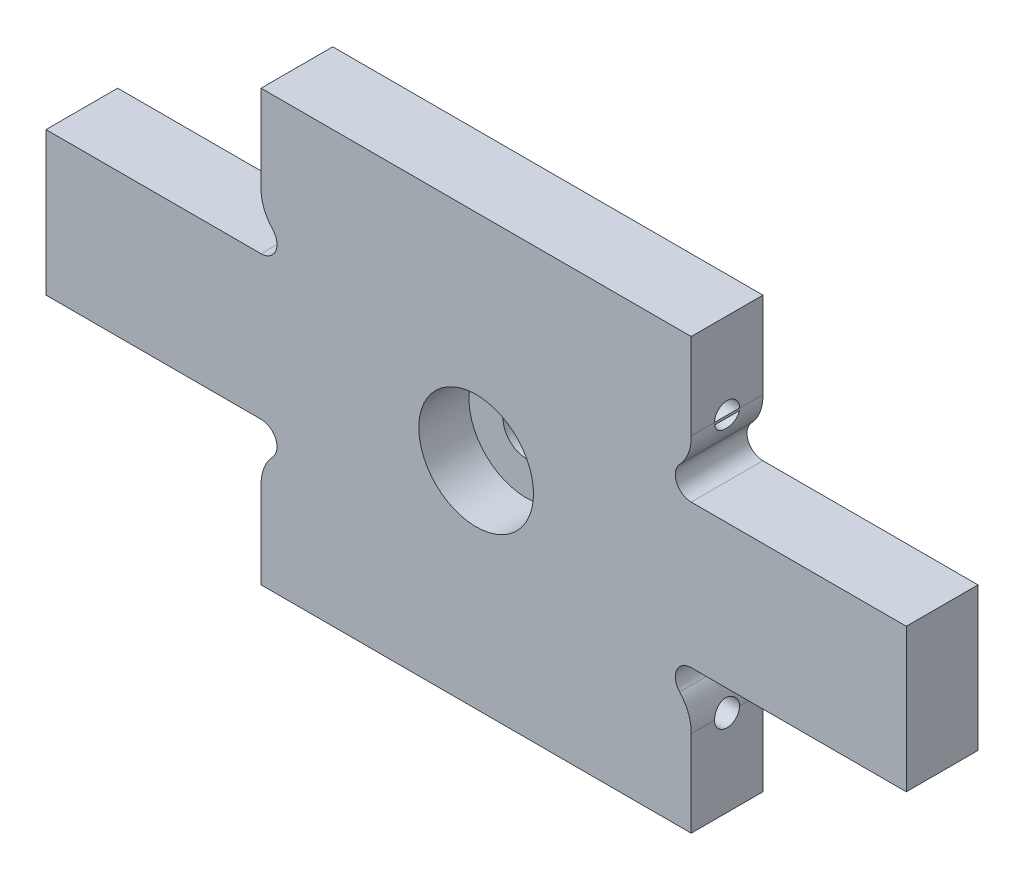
ISO-10303-21;
HEADER;
FILE_DESCRIPTION(('STEP AP214'),'2;1');
FILE_NAME('part.step','',(''),(''),'','','');
FILE_SCHEMA(('AUTOMOTIVE_DESIGN { 1 0 10303 214 1 1 1 1 }'));
ENDSEC;
DATA;
#1=APPLICATION_CONTEXT('core data for automotive mechanical design processes');
#2=APPLICATION_PROTOCOL_DEFINITION('international standard','automotive_design',2000,#1);
#3=PRODUCT_CONTEXT('',#1,'mechanical');
#4=PRODUCT('Part','Part','',(#3));
#5=PRODUCT_RELATED_PRODUCT_CATEGORY('part','',(#4));
#6=PRODUCT_DEFINITION_FORMATION('','',#4);
#7=PRODUCT_DEFINITION_CONTEXT('part definition',#1,'design');
#8=PRODUCT_DEFINITION('design','',#6,#7);
#9=PRODUCT_DEFINITION_SHAPE('','',#8);
#10=(LENGTH_UNIT() NAMED_UNIT(*) SI_UNIT(.MILLI.,.METRE.));
#11=(NAMED_UNIT(*) PLANE_ANGLE_UNIT() SI_UNIT($,.RADIAN.));
#12=(NAMED_UNIT(*) SI_UNIT($,.STERADIAN.) SOLID_ANGLE_UNIT());
#13=UNCERTAINTY_MEASURE_WITH_UNIT(LENGTH_MEASURE(1.E-05),#10,'distance_accuracy_value','');
#14=(GEOMETRIC_REPRESENTATION_CONTEXT(3) GLOBAL_UNCERTAINTY_ASSIGNED_CONTEXT((#13)) GLOBAL_UNIT_ASSIGNED_CONTEXT((#10,
#11,#12)) REPRESENTATION_CONTEXT('',''));
#15=CARTESIAN_POINT('',(0.,0.,0.));
#16=DIRECTION('',(0.,0.,1.));
#17=DIRECTION('',(1.,0.,0.));
#18=AXIS2_PLACEMENT_3D('',#15,#16,#17);
#19=CARTESIAN_POINT('',(30.,30.,10.));
#20=DIRECTION('',(-1.,0.,0.));
#21=DIRECTION('',(0.,-1.,0.));
#22=AXIS2_PLACEMENT_3D('',#19,#20,#21);
#23=PLANE('',#22);
#24=CARTESIAN_POINT('',(30.,18.,5.));
#25=DIRECTION('',(1.,0.,0.));
#26=DIRECTION('',(0.,0.,-1.));
#27=AXIS2_PLACEMENT_3D('',#24,#25,#26);
#28=CIRCLE('',#27,1.74999999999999);
#29=CARTESIAN_POINT('',(30.,18.,3.25000000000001));
#30=VERTEX_POINT('',#29);
#31=CARTESIAN_POINT('',(30.,18.,6.74999999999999));
#32=VERTEX_POINT('',#31);
#33=EDGE_CURVE('E240',#30,#32,#28,.T.);
#34=ORIENTED_EDGE('',*,*,#33,.F.);
#35=DIRECTION('',(0.,0.,-1.));
#36=VECTOR('',#35,1.);
#37=CARTESIAN_POINT('',(30.,18.,10.));
#38=LINE('',#37,#36);
#39=CARTESIAN_POINT('',(30.,18.,0.));
#40=VERTEX_POINT('',#39);
#41=EDGE_CURVE('E487',#30,#40,#38,.T.);
#42=ORIENTED_EDGE('',*,*,#41,.T.);
#43=DIRECTION('',(0.,1.,0.));
#44=VECTOR('',#43,1.);
#45=CARTESIAN_POINT('',(30.,30.,0.));
#46=LINE('',#45,#44);
#47=CARTESIAN_POINT('',(30.,30.,0.));
#48=VERTEX_POINT('',#47);
#49=EDGE_CURVE('E349',#40,#48,#46,.T.);
#50=ORIENTED_EDGE('',*,*,#49,.T.);
#51=DIRECTION('',(0.,0.,-1.));
#52=VECTOR('',#51,1.);
#53=CARTESIAN_POINT('',(30.,30.,10.));
#54=LINE('',#53,#52);
#55=CARTESIAN_POINT('',(30.,30.,10.));
#56=VERTEX_POINT('',#55);
#57=EDGE_CURVE('E483',#56,#48,#54,.T.);
#58=ORIENTED_EDGE('',*,*,#57,.F.);
#59=DIRECTION('',(0.,1.,0.));
#60=VECTOR('',#59,1.);
#61=CARTESIAN_POINT('',(30.,30.,10.));
#62=LINE('',#61,#60);
#63=CARTESIAN_POINT('',(30.,18.,10.));
#64=VERTEX_POINT('',#63);
#65=EDGE_CURVE('E287',#64,#56,#62,.T.);
#66=ORIENTED_EDGE('',*,*,#65,.F.);
#67=EDGE_CURVE('E488',#64,#32,#38,.T.);
#68=ORIENTED_EDGE('',*,*,#67,.T.);
#69=EDGE_LOOP('',(#34,#42,#50,#58,#66,#68));
#70=FACE_BOUND('',#69,.T.);
#71=ADVANCED_FACE('F45',(#70),#23,.F.);
#72=CARTESIAN_POINT('',(0.,0.,0.));
#73=DIRECTION('',(0.,0.,1.));
#74=DIRECTION('',(1.,0.,0.));
#75=AXIS2_PLACEMENT_3D('',#72,#73,#74);
#76=CYLINDRICAL_SURFACE('',#75,3.25);
#77=CARTESIAN_POINT('',(0.,0.,0.));
#78=DIRECTION('',(0.,0.,1.));
#79=DIRECTION('',(1.,0.,0.));
#80=AXIS2_PLACEMENT_3D('',#77,#78,#79);
#81=CIRCLE('',#80,3.25);
#82=CARTESIAN_POINT('',(3.25,0.,0.));
#83=VERTEX_POINT('',#82);
#84=EDGE_CURVE('E278',#83,#83,#81,.T.);
#85=ORIENTED_EDGE('',*,*,#84,.F.);
#86=EDGE_LOOP('',(#85));
#87=FACE_BOUND('',#86,.T.);
#88=CARTESIAN_POINT('',(0.,0.,3.));
#89=DIRECTION('',(0.,0.,1.));
#90=DIRECTION('',(1.,0.,0.));
#91=AXIS2_PLACEMENT_3D('',#88,#89,#90);
#92=CIRCLE('',#91,3.25);
#93=CARTESIAN_POINT('',(3.25,0.,3.));
#94=VERTEX_POINT('',#93);
#95=EDGE_CURVE('E274',#94,#94,#92,.F.);
#96=ORIENTED_EDGE('',*,*,#95,.F.);
#97=EDGE_LOOP('',(#96));
#98=FACE_BOUND('',#97,.T.);
#99=ADVANCED_FACE('F539',(#87,#98),#76,.F.);
#100=CARTESIAN_POINT('',(24.0021116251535,17.8408301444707,10.));
#101=DIRECTION('',(0.,0.,-1.));
#102=DIRECTION('',(-1.,0.,0.));
#103=AXIS2_PLACEMENT_3D('',#100,#101,#102);
#104=CYLINDRICAL_SURFACE('',#103,6.00000000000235);
#105=CARTESIAN_POINT('',(30.,17.6816602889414,3.27919791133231));
#106=CARTESIAN_POINT('',(29.9987313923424,17.6337424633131,3.28806184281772));
#107=CARTESIAN_POINT('',(29.9968924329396,17.5862353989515,3.29892223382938));
#108=CARTESIAN_POINT('',(29.9921670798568,17.4923496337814,3.32454189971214));
#109=CARTESIAN_POINT('',(29.989280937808,17.4459706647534,3.33930023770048));
#110=CARTESIAN_POINT('',(29.9792095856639,17.3092146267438,3.38919308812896));
#111=CARTESIAN_POINT('',(29.9706030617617,17.2209391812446,3.42999758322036));
#112=CARTESIAN_POINT('',(29.9507233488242,17.0526542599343,3.52541371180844));
#113=CARTESIAN_POINT('',(29.9394511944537,16.9726415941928,3.58001998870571));
#114=CARTESIAN_POINT('',(29.9155983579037,16.8227748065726,3.70155930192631));
#115=CARTESIAN_POINT('',(29.9030172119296,16.7529243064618,3.76849671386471));
#116=CARTESIAN_POINT('',(29.8777467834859,16.6237217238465,3.91460477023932));
#117=CARTESIAN_POINT('',(29.8650614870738,16.5646427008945,3.99401777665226));
#118=CARTESIAN_POINT('',(29.8414450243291,16.4605977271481,4.16185492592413));
#119=CARTESIAN_POINT('',(29.8305138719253,16.4156318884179,4.2502791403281));
#120=CARTESIAN_POINT('',(29.8118198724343,16.3412405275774,4.43361922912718));
#121=CARTESIAN_POINT('',(29.8040524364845,16.3117924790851,4.52852546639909));
#122=CARTESIAN_POINT('',(29.7927035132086,16.2693540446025,4.72218092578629));
#123=CARTESIAN_POINT('',(29.7891208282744,16.256358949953,4.82092904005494));
#124=CARTESIAN_POINT('',(29.7866706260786,16.2474389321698,5.0160343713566));
#125=CARTESIAN_POINT('',(29.7876541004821,16.2509745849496,5.11236539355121));
#126=CARTESIAN_POINT('',(29.7938668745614,16.2737603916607,5.30300554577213));
#127=CARTESIAN_POINT('',(29.7990961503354,16.2930104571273,5.39731468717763));
#128=CARTESIAN_POINT('',(29.8130743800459,16.3463546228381,5.58050609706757));
#129=CARTESIAN_POINT('',(29.8217943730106,16.380326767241,5.6694262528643));
#130=CARTESIAN_POINT('',(29.8416979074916,16.4620650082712,5.84037847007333));
#131=CARTESIAN_POINT('',(29.852881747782,16.5098327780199,5.92240969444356));
#132=CARTESIAN_POINT('',(29.8767647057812,16.6194848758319,6.07988667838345));
#133=CARTESIAN_POINT('',(29.8894989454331,16.6817461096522,6.15506471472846));
#134=CARTESIAN_POINT('',(29.914681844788,16.8179421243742,6.2941067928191));
#135=CARTESIAN_POINT('',(29.9271303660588,16.8918824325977,6.3579654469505));
#136=CARTESIAN_POINT('',(29.9504593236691,17.0510508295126,6.47372665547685));
#137=CARTESIAN_POINT('',(29.9613048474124,17.1364692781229,6.52537458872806));
#138=CARTESIAN_POINT('',(29.9797000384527,17.3150510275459,6.61344855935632));
#139=CARTESIAN_POINT('',(29.9872558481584,17.4081995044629,6.64990295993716));
#140=CARTESIAN_POINT('',(29.9942830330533,17.5330112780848,6.68681922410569));
#141=CARTESIAN_POINT('',(29.9957265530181,17.5625013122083,6.69470639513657));
#142=CARTESIAN_POINT('',(29.9981864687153,17.6218268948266,6.70892101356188));
#143=CARTESIAN_POINT('',(29.9992034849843,17.6516618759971,6.7152507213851));
#144=CARTESIAN_POINT('',(30.,17.6816602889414,6.72080208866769));
#145=B_SPLINE_CURVE_WITH_KNOTS('',3,(#105,#106,#107,#108,#109,#110,#111,#112,#113,#114,#115,
#116,#117,#118,#119,#120,#121,#122,#123,#124,#125,#126,#127,#128,#129,#130,#131,#132,#133,#134,
#135,#136,#137,#138,#139,#140,#141,#142,#143,#144),.UNSPECIFIED.,.F.,.F.,(4,2,2,2,2,2,2,2,2,2,2,
2,2,2,2,2,2,2,2,4),(0.,0.146146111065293,0.292257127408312,0.583637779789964,0.874905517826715,
1.16627680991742,1.4642356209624,1.76219679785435,2.05972423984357,2.35716651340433,
2.64497179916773,2.93277546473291,3.21823925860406,3.50373768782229,3.79770983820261,
4.09182153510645,4.39161125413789,4.69083879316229,4.7824893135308,4.8740060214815),.UNSPECIFIED.);
#146=CARTESIAN_POINT('',(30.,17.6816602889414,3.27919791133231));
#147=VERTEX_POINT('',#146);
#148=CARTESIAN_POINT('',(30.,17.6816602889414,6.72080208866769));
#149=VERTEX_POINT('',#148);
#150=EDGE_CURVE('E55',#147,#149,#145,.T.);
#151=ORIENTED_EDGE('',*,*,#150,.T.);
#152=DIRECTION('',(0.,0.,-1.));
#153=VECTOR('',#152,1.);
#154=CARTESIAN_POINT('',(30.,17.6816602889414,10.));
#155=LINE('',#154,#153);
#156=EDGE_CURVE('E11',#149,#147,#155,.T.);
#157=ORIENTED_EDGE('',*,*,#156,.T.);
#158=EDGE_LOOP('',(#151,#157));
#159=FACE_BOUND('',#158,.T.);
#160=CARTESIAN_POINT('',(24.0021116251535,17.8408301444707,0.));
#161=DIRECTION('',(0.,0.,1.));
#162=DIRECTION('',(-1.,0.,0.));
#163=AXIS2_PLACEMENT_3D('',#160,#161,#162);
#164=CIRCLE('',#163,6.00000000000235);
#165=CARTESIAN_POINT('',(28.3795620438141,13.7374257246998,0.));
#166=VERTEX_POINT('',#165);
#167=EDGE_CURVE('E282',#166,#40,#164,.T.);
#168=ORIENTED_EDGE('',*,*,#167,.T.);
#169=ORIENTED_EDGE('',*,*,#41,.F.);
#170=EDGE_CURVE('E493',#32,#30,#38,.T.);
#171=ORIENTED_EDGE('',*,*,#170,.F.);
#172=ORIENTED_EDGE('',*,*,#67,.F.);
#173=CARTESIAN_POINT('',(24.0021116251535,17.8408301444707,10.));
#174=DIRECTION('',(0.,0.,1.));
#175=DIRECTION('',(-1.,0.,0.));
#176=AXIS2_PLACEMENT_3D('',#173,#174,#175);
#177=CIRCLE('',#176,6.00000000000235);
#178=CARTESIAN_POINT('',(28.3795620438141,13.7374257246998,10.));
#179=VERTEX_POINT('',#178);
#180=EDGE_CURVE('E283',#179,#64,#177,.T.);
#181=ORIENTED_EDGE('',*,*,#180,.F.);
#182=DIRECTION('',(0.,0.,-1.));
#183=VECTOR('',#182,1.);
#184=CARTESIAN_POINT('',(28.3795620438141,13.7374257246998,10.));
#185=LINE('',#184,#183);
#186=EDGE_CURVE('E345',#179,#166,#185,.T.);
#187=ORIENTED_EDGE('',*,*,#186,.T.);
#188=EDGE_LOOP('',(#168,#169,#171,#172,#181,#187));
#189=FACE_BOUND('',#188,.T.);
#190=ADVANCED_FACE('F47',(#159,#189),#104,.T.);
#191=CARTESIAN_POINT('',(30.,30.,10.));
#192=DIRECTION('',(0.,-1.,0.));
#193=DIRECTION('',(1.,0.,0.));
#194=AXIS2_PLACEMENT_3D('',#191,#192,#193);
#195=PLANE('',#194);
#196=DIRECTION('',(-1.,0.,0.));
#197=VECTOR('',#196,1.);
#198=CARTESIAN_POINT('',(30.,30.,0.));
#199=LINE('',#198,#197);
#200=CARTESIAN_POINT('',(-30.,30.,0.));
#201=VERTEX_POINT('',#200);
#202=EDGE_CURVE('E352',#48,#201,#199,.T.);
#203=ORIENTED_EDGE('',*,*,#202,.T.);
#204=DIRECTION('',(0.,0.,-1.));
#205=VECTOR('',#204,1.);
#206=CARTESIAN_POINT('',(-30.,30.,10.));
#207=LINE('',#206,#205);
#208=CARTESIAN_POINT('',(-30.,30.,10.));
#209=VERTEX_POINT('',#208);
#210=EDGE_CURVE('E478',#209,#201,#207,.T.);
#211=ORIENTED_EDGE('',*,*,#210,.F.);
#212=DIRECTION('',(-1.,0.,0.));
#213=VECTOR('',#212,1.);
#214=CARTESIAN_POINT('',(30.,30.,10.));
#215=LINE('',#214,#213);
#216=EDGE_CURVE('E291',#56,#209,#215,.T.);
#217=ORIENTED_EDGE('',*,*,#216,.F.);
#218=ORIENTED_EDGE('',*,*,#57,.T.);
#219=EDGE_LOOP('',(#203,#211,#217,#218));
#220=FACE_BOUND('',#219,.T.);
#221=ADVANCED_FACE('F619',(#220),#195,.F.);
#222=CARTESIAN_POINT('',(-30.,30.,10.));
#223=DIRECTION('',(1.,0.,0.));
#224=DIRECTION('',(0.,1.,0.));
#225=AXIS2_PLACEMENT_3D('',#222,#223,#224);
#226=PLANE('',#225);
#227=DIRECTION('',(0.,0.,-1.));
#228=VECTOR('',#227,1.);
#229=CARTESIAN_POINT('',(-30.,18.,10.));
#230=LINE('',#229,#228);
#231=CARTESIAN_POINT('',(-30.,18.,3.25000000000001));
#232=VERTEX_POINT('',#231);
#233=CARTESIAN_POINT('',(-30.,18.,0.));
#234=VERTEX_POINT('',#233);
#235=EDGE_CURVE('E473',#232,#234,#230,.T.);
#236=ORIENTED_EDGE('',*,*,#235,.F.);
#237=CARTESIAN_POINT('',(-30.,18.,5.));
#238=DIRECTION('',(-1.,0.,0.));
#239=DIRECTION('',(0.,0.,1.));
#240=AXIS2_PLACEMENT_3D('',#237,#238,#239);
#241=CIRCLE('',#240,1.74999999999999);
#242=CARTESIAN_POINT('',(-30.,18.,6.74999999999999));
#243=VERTEX_POINT('',#242);
#244=EDGE_CURVE('E253',#243,#232,#241,.T.);
#245=ORIENTED_EDGE('',*,*,#244,.F.);
#246=CARTESIAN_POINT('',(-30.,18.,10.));
#247=VERTEX_POINT('',#246);
#248=EDGE_CURVE('E474',#247,#243,#230,.T.);
#249=ORIENTED_EDGE('',*,*,#248,.F.);
#250=DIRECTION('',(0.,-1.,0.));
#251=VECTOR('',#250,1.);
#252=CARTESIAN_POINT('',(-30.,30.,10.));
#253=LINE('',#252,#251);
#254=EDGE_CURVE('E294',#209,#247,#253,.T.);
#255=ORIENTED_EDGE('',*,*,#254,.F.);
#256=ORIENTED_EDGE('',*,*,#210,.T.);
#257=DIRECTION('',(0.,-1.,0.));
#258=VECTOR('',#257,1.);
#259=CARTESIAN_POINT('',(-30.,30.,0.));
#260=LINE('',#259,#258);
#261=EDGE_CURVE('E355',#201,#234,#260,.T.);
#262=ORIENTED_EDGE('',*,*,#261,.T.);
#263=EDGE_LOOP('',(#236,#245,#249,#255,#256,#262));
#264=FACE_BOUND('',#263,.T.);
#265=ADVANCED_FACE('F622',(#264),#226,.F.);
#266=CARTESIAN_POINT('',(-24.0021116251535,17.8408301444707,10.));
#267=DIRECTION('',(0.,0.,-1.));
#268=DIRECTION('',(-1.,0.,0.));
#269=AXIS2_PLACEMENT_3D('',#266,#267,#268);
#270=CYLINDRICAL_SURFACE('',#269,6.00000000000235);
#271=CARTESIAN_POINT('',(-30.,17.6816602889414,6.72080208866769));
#272=CARTESIAN_POINT('',(-29.9987313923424,17.6337424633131,6.71193815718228));
#273=CARTESIAN_POINT('',(-29.9968924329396,17.5862353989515,6.70107776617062));
#274=CARTESIAN_POINT('',(-29.9921670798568,17.4923496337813,6.67545810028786));
#275=CARTESIAN_POINT('',(-29.989280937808,17.4459706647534,6.66069976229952));
#276=CARTESIAN_POINT('',(-29.9792095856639,17.3092146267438,6.61080691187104));
#277=CARTESIAN_POINT('',(-29.9706030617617,17.2209391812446,6.57000241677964));
#278=CARTESIAN_POINT('',(-29.9507233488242,17.0526542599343,6.47458628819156));
#279=CARTESIAN_POINT('',(-29.9394511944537,16.9726415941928,6.41998001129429));
#280=CARTESIAN_POINT('',(-29.9155983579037,16.8227748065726,6.29844069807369));
#281=CARTESIAN_POINT('',(-29.9030172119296,16.7529243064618,6.23150328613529));
#282=CARTESIAN_POINT('',(-29.8777467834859,16.6237217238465,6.08539522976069));
#283=CARTESIAN_POINT('',(-29.8650614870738,16.5646427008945,6.00598222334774));
#284=CARTESIAN_POINT('',(-29.8414450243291,16.4605977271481,5.83814507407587));
#285=CARTESIAN_POINT('',(-29.8305138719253,16.4156318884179,5.7497208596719));
#286=CARTESIAN_POINT('',(-29.8118198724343,16.3412405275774,5.56638077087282));
#287=CARTESIAN_POINT('',(-29.8040524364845,16.3117924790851,5.47147453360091));
#288=CARTESIAN_POINT('',(-29.7927035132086,16.2693540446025,5.27781907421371));
#289=CARTESIAN_POINT('',(-29.7891208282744,16.256358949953,5.17907095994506));
#290=CARTESIAN_POINT('',(-29.7866706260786,16.2474389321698,4.9839656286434));
#291=CARTESIAN_POINT('',(-29.7876541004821,16.2509745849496,4.88763460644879));
#292=CARTESIAN_POINT('',(-29.7938668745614,16.2737603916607,4.69699445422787));
#293=CARTESIAN_POINT('',(-29.7990961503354,16.2930104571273,4.60268531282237));
#294=CARTESIAN_POINT('',(-29.8130743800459,16.3463546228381,4.41949390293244));
#295=CARTESIAN_POINT('',(-29.8217943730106,16.380326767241,4.33057374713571));
#296=CARTESIAN_POINT('',(-29.8416979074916,16.4620650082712,4.15962152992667));
#297=CARTESIAN_POINT('',(-29.852881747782,16.5098327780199,4.07759030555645));
#298=CARTESIAN_POINT('',(-29.8767647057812,16.6194848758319,3.92011332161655));
#299=CARTESIAN_POINT('',(-29.8894989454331,16.6817461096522,3.84493528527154));
#300=CARTESIAN_POINT('',(-29.914681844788,16.8179421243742,3.7058932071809));
#301=CARTESIAN_POINT('',(-29.9271303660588,16.8918824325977,3.64203455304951));
#302=CARTESIAN_POINT('',(-29.9504593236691,17.0510508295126,3.52627334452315));
#303=CARTESIAN_POINT('',(-29.9613048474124,17.1364692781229,3.47462541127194));
#304=CARTESIAN_POINT('',(-29.9797000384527,17.3150510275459,3.38655144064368));
#305=CARTESIAN_POINT('',(-29.9872558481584,17.4081995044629,3.35009704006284));
#306=CARTESIAN_POINT('',(-29.9942830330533,17.5330112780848,3.31318077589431));
#307=CARTESIAN_POINT('',(-29.9957265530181,17.5625013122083,3.30529360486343));
#308=CARTESIAN_POINT('',(-29.9981864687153,17.6218268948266,3.29107898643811));
#309=CARTESIAN_POINT('',(-29.9992034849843,17.6516618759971,3.2847492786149));
#310=CARTESIAN_POINT('',(-30.,17.6816602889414,3.27919791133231));
#311=B_SPLINE_CURVE_WITH_KNOTS('',3,(#271,#272,#273,#274,#275,#276,#277,#278,#279,#280,#281,
#282,#283,#284,#285,#286,#287,#288,#289,#290,#291,#292,#293,#294,#295,#296,#297,#298,#299,#300,
#301,#302,#303,#304,#305,#306,#307,#308,#309,#310),.UNSPECIFIED.,.F.,.F.,(4,2,2,2,2,2,2,2,2,2,2,
2,2,2,2,2,2,2,2,4),(0.,0.146146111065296,0.292257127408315,0.583637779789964,0.874905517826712,
1.16627680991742,1.4642356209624,1.76219679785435,2.05972423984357,2.35716651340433,
2.64497179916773,2.93277546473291,3.21823925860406,3.50373768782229,3.79770983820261,
4.09182153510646,4.39161125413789,4.69083879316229,4.7824893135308,4.87400602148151),.UNSPECIFIED.);
#312=CARTESIAN_POINT('',(-30.,17.6816602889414,6.72080208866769));
#313=VERTEX_POINT('',#312);
#314=CARTESIAN_POINT('',(-30.,17.6816602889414,3.27919791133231));
#315=VERTEX_POINT('',#314);
#316=EDGE_CURVE('E506',#313,#315,#311,.T.);
#317=ORIENTED_EDGE('',*,*,#316,.T.);
#318=DIRECTION('',(0.,0.,-1.));
#319=VECTOR('',#318,1.);
#320=CARTESIAN_POINT('',(-30.,17.6816602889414,10.));
#321=LINE('',#320,#319);
#322=EDGE_CURVE('E586',#315,#313,#321,.F.);
#323=ORIENTED_EDGE('',*,*,#322,.T.);
#324=EDGE_LOOP('',(#317,#323));
#325=FACE_BOUND('',#324,.T.);
#326=CARTESIAN_POINT('',(-24.0021116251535,17.8408301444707,0.));
#327=DIRECTION('',(0.,0.,1.));
#328=DIRECTION('',(1.,0.,0.));
#329=AXIS2_PLACEMENT_3D('',#326,#327,#328);
#330=CIRCLE('',#329,6.00000000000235);
#331=CARTESIAN_POINT('',(-28.3795620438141,13.7374257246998,0.));
#332=VERTEX_POINT('',#331);
#333=EDGE_CURVE('E359',#234,#332,#330,.T.);
#334=ORIENTED_EDGE('',*,*,#333,.T.);
#335=DIRECTION('',(0.,0.,-1.));
#336=VECTOR('',#335,1.);
#337=CARTESIAN_POINT('',(-28.3795620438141,13.7374257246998,10.));
#338=LINE('',#337,#336);
#339=CARTESIAN_POINT('',(-28.3795620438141,13.7374257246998,10.));
#340=VERTEX_POINT('',#339);
#341=EDGE_CURVE('E469',#340,#332,#338,.T.);
#342=ORIENTED_EDGE('',*,*,#341,.F.);
#343=CARTESIAN_POINT('',(-24.0021116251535,17.8408301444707,10.));
#344=DIRECTION('',(0.,0.,1.));
#345=DIRECTION('',(1.,0.,0.));
#346=AXIS2_PLACEMENT_3D('',#343,#344,#345);
#347=CIRCLE('',#346,6.00000000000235);
#348=EDGE_CURVE('E297',#247,#340,#347,.T.);
#349=ORIENTED_EDGE('',*,*,#348,.F.);
#350=ORIENTED_EDGE('',*,*,#248,.T.);
#351=EDGE_CURVE('E479',#243,#232,#230,.T.);
#352=ORIENTED_EDGE('',*,*,#351,.T.);
#353=ORIENTED_EDGE('',*,*,#235,.T.);
#354=EDGE_LOOP('',(#334,#342,#349,#350,#352,#353));
#355=FACE_BOUND('',#354,.T.);
#356=ADVANCED_FACE('F625',(#325,#355),#270,.T.);
#357=CARTESIAN_POINT('',(-30.000000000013,12.2199999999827,10.));
#358=DIRECTION('',(0.,0.,-1.));
#359=DIRECTION('',(-1.,0.,0.));
#360=AXIS2_PLACEMENT_3D('',#357,#358,#359);
#361=CYLINDRICAL_SURFACE('',#360,2.21999999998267);
#362=CARTESIAN_POINT('',(-30.000000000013,12.2199999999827,0.));
#363=DIRECTION('',(0.,0.,-1.));
#364=DIRECTION('',(1.,0.,0.));
#365=AXIS2_PLACEMENT_3D('',#362,#363,#364);
#366=CIRCLE('',#365,2.21999999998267);
#367=CARTESIAN_POINT('',(-30.000000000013,10.,0.));
#368=VERTEX_POINT('',#367);
#369=EDGE_CURVE('E362',#332,#368,#366,.T.);
#370=ORIENTED_EDGE('',*,*,#369,.T.);
#371=DIRECTION('',(0.,0.,-1.));
#372=VECTOR('',#371,1.);
#373=CARTESIAN_POINT('',(-30.000000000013,10.,10.));
#374=LINE('',#373,#372);
#375=CARTESIAN_POINT('',(-30.000000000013,10.,10.));
#376=VERTEX_POINT('',#375);
#377=EDGE_CURVE('E465',#376,#368,#374,.T.);
#378=ORIENTED_EDGE('',*,*,#377,.F.);
#379=CARTESIAN_POINT('',(-30.000000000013,12.2199999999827,10.));
#380=DIRECTION('',(0.,0.,-1.));
#381=DIRECTION('',(1.,0.,0.));
#382=AXIS2_PLACEMENT_3D('',#379,#380,#381);
#383=CIRCLE('',#382,2.21999999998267);
#384=EDGE_CURVE('E300',#340,#376,#383,.T.);
#385=ORIENTED_EDGE('',*,*,#384,.F.);
#386=ORIENTED_EDGE('',*,*,#341,.T.);
#387=EDGE_LOOP('',(#370,#378,#385,#386));
#388=FACE_BOUND('',#387,.T.);
#389=ADVANCED_FACE('F630',(#388),#361,.F.);
#390=CARTESIAN_POINT('',(-30.000000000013,10.,10.));
#391=DIRECTION('',(0.,-1.,0.));
#392=DIRECTION('',(0.,0.,-1.));
#393=AXIS2_PLACEMENT_3D('',#390,#391,#392);
#394=PLANE('',#393);
#395=DIRECTION('',(-1.,0.,0.));
#396=VECTOR('',#395,1.);
#397=CARTESIAN_POINT('',(-30.000000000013,10.,0.));
#398=LINE('',#397,#396);
#399=CARTESIAN_POINT('',(-60.,10.,0.));
#400=VERTEX_POINT('',#399);
#401=EDGE_CURVE('E365',#368,#400,#398,.T.);
#402=ORIENTED_EDGE('',*,*,#401,.T.);
#403=DIRECTION('',(0.,0.,-1.));
#404=VECTOR('',#403,1.);
#405=CARTESIAN_POINT('',(-60.,10.,10.));
#406=LINE('',#405,#404);
#407=CARTESIAN_POINT('',(-60.,10.,10.));
#408=VERTEX_POINT('',#407);
#409=EDGE_CURVE('E461',#408,#400,#406,.T.);
#410=ORIENTED_EDGE('',*,*,#409,.F.);
#411=DIRECTION('',(-1.,0.,0.));
#412=VECTOR('',#411,1.);
#413=CARTESIAN_POINT('',(-30.000000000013,10.,10.));
#414=LINE('',#413,#412);
#415=EDGE_CURVE('E303',#376,#408,#414,.T.);
#416=ORIENTED_EDGE('',*,*,#415,.F.);
#417=ORIENTED_EDGE('',*,*,#377,.T.);
#418=EDGE_LOOP('',(#402,#410,#416,#417));
#419=FACE_BOUND('',#418,.T.);
#420=ADVANCED_FACE('F634',(#419),#394,.F.);
#421=CARTESIAN_POINT('',(-60.,10.,10.));
#422=DIRECTION('',(1.,0.,0.));
#423=DIRECTION('',(0.,0.,-1.));
#424=AXIS2_PLACEMENT_3D('',#421,#422,#423);
#425=PLANE('',#424);
#426=DIRECTION('',(0.,-1.,0.));
#427=VECTOR('',#426,1.);
#428=CARTESIAN_POINT('',(-60.,10.,0.));
#429=LINE('',#428,#427);
#430=CARTESIAN_POINT('',(-60.,-10.,0.));
#431=VERTEX_POINT('',#430);
#432=EDGE_CURVE('E368',#400,#431,#429,.T.);
#433=ORIENTED_EDGE('',*,*,#432,.T.);
#434=DIRECTION('',(0.,0.,-1.));
#435=VECTOR('',#434,1.);
#436=CARTESIAN_POINT('',(-60.,-10.,10.));
#437=LINE('',#436,#435);
#438=CARTESIAN_POINT('',(-60.,-10.,10.));
#439=VERTEX_POINT('',#438);
#440=EDGE_CURVE('E457',#439,#431,#437,.T.);
#441=ORIENTED_EDGE('',*,*,#440,.F.);
#442=DIRECTION('',(0.,-1.,0.));
#443=VECTOR('',#442,1.);
#444=CARTESIAN_POINT('',(-60.,10.,10.));
#445=LINE('',#444,#443);
#446=EDGE_CURVE('E306',#408,#439,#445,.T.);
#447=ORIENTED_EDGE('',*,*,#446,.F.);
#448=ORIENTED_EDGE('',*,*,#409,.T.);
#449=EDGE_LOOP('',(#433,#441,#447,#448));
#450=FACE_BOUND('',#449,.T.);
#451=ADVANCED_FACE('F638',(#450),#425,.F.);
#452=CARTESIAN_POINT('',(-60.,-10.,10.));
#453=DIRECTION('',(0.,1.,0.));
#454=DIRECTION('',(-1.,0.,0.));
#455=AXIS2_PLACEMENT_3D('',#452,#453,#454);
#456=PLANE('',#455);
#457=DIRECTION('',(1.,0.,0.));
#458=VECTOR('',#457,1.);
#459=CARTESIAN_POINT('',(-60.,-10.,0.));
#460=LINE('',#459,#458);
#461=CARTESIAN_POINT('',(-30.000000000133,-9.99999999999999,0.));
#462=VERTEX_POINT('',#461);
#463=EDGE_CURVE('E371',#431,#462,#460,.T.);
#464=ORIENTED_EDGE('',*,*,#463,.T.);
#465=DIRECTION('',(0.,0.,-1.));
#466=VECTOR('',#465,1.);
#467=CARTESIAN_POINT('',(-30.000000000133,-9.99999999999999,10.));
#468=LINE('',#467,#466);
#469=CARTESIAN_POINT('',(-30.000000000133,-9.99999999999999,10.));
#470=VERTEX_POINT('',#469);
#471=EDGE_CURVE('E453',#470,#462,#468,.T.);
#472=ORIENTED_EDGE('',*,*,#471,.F.);
#473=DIRECTION('',(1.,0.,0.));
#474=VECTOR('',#473,1.);
#475=CARTESIAN_POINT('',(-60.,-10.,10.));
#476=LINE('',#475,#474);
#477=EDGE_CURVE('E309',#439,#470,#476,.T.);
#478=ORIENTED_EDGE('',*,*,#477,.F.);
#479=ORIENTED_EDGE('',*,*,#440,.T.);
#480=EDGE_LOOP('',(#464,#472,#478,#479));
#481=FACE_BOUND('',#480,.T.);
#482=ADVANCED_FACE('F642',(#481),#456,.F.);
#483=CARTESIAN_POINT('',(-30.000000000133,-12.2200000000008,10.));
#484=DIRECTION('',(0.,0.,-1.));
#485=DIRECTION('',(-1.,0.,0.));
#486=AXIS2_PLACEMENT_3D('',#483,#484,#485);
#487=CYLINDRICAL_SURFACE('',#486,2.22000000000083);
#488=CARTESIAN_POINT('',(-30.000000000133,-12.2200000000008,0.));
#489=DIRECTION('',(0.,0.,-1.));
#490=DIRECTION('',(1.,0.,0.));
#491=AXIS2_PLACEMENT_3D('',#488,#489,#490);
#492=CIRCLE('',#491,2.22000000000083);
#493=CARTESIAN_POINT('',(-28.3795620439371,-13.7374257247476,0.));
#494=VERTEX_POINT('',#493);
#495=EDGE_CURVE('E374',#462,#494,#492,.T.);
#496=ORIENTED_EDGE('',*,*,#495,.T.);
#497=DIRECTION('',(0.,0.,-1.));
#498=VECTOR('',#497,1.);
#499=CARTESIAN_POINT('',(-28.3795620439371,-13.7374257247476,10.));
#500=LINE('',#499,#498);
#501=CARTESIAN_POINT('',(-28.3795620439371,-13.7374257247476,10.));
#502=VERTEX_POINT('',#501);
#503=EDGE_CURVE('E449',#502,#494,#500,.T.);
#504=ORIENTED_EDGE('',*,*,#503,.F.);
#505=CARTESIAN_POINT('',(-30.000000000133,-12.2200000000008,10.));
#506=DIRECTION('',(0.,0.,-1.));
#507=DIRECTION('',(1.,0.,0.));
#508=AXIS2_PLACEMENT_3D('',#505,#506,#507);
#509=CIRCLE('',#508,2.22000000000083);
#510=EDGE_CURVE('E312',#470,#502,#509,.T.);
#511=ORIENTED_EDGE('',*,*,#510,.F.);
#512=ORIENTED_EDGE('',*,*,#471,.T.);
#513=EDGE_LOOP('',(#496,#504,#511,#512));
#514=FACE_BOUND('',#513,.T.);
#515=ADVANCED_FACE('F645',(#514),#487,.F.);
#516=CARTESIAN_POINT('',(-24.0000000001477,-17.8385763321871,10.));
#517=DIRECTION('',(0.,0.,-1.));
#518=DIRECTION('',(-1.,0.,0.));
#519=AXIS2_PLACEMENT_3D('',#516,#517,#518);
#520=CYLINDRICAL_SURFACE('',#519,6.00000000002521);
#521=DIRECTION('',(0.,0.,-1.));
#522=VECTOR('',#521,1.);
#523=CARTESIAN_POINT('',(-29.9978281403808,-18.,10.));
#524=LINE('',#523,#522);
#525=CARTESIAN_POINT('',(-29.9978281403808,-18.,3.25000000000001));
#526=VERTEX_POINT('',#525);
#527=CARTESIAN_POINT('',(-29.9978281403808,-18.,0.));
#528=VERTEX_POINT('',#527);
#529=EDGE_CURVE('E444',#526,#528,#524,.T.);
#530=ORIENTED_EDGE('',*,*,#529,.F.);
#531=CARTESIAN_POINT('',(-29.9978281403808,-18.,3.25000000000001));
#532=CARTESIAN_POINT('',(-29.9991213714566,-17.9520643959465,3.2499992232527));
#533=CARTESIAN_POINT('',(-29.9998323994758,-17.9041364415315,3.25197087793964));
#534=CARTESIAN_POINT('',(-30.000114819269,-17.8086077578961,3.25983702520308));
#535=CARTESIAN_POINT('',(-29.9996863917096,-17.7610069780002,3.26573089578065));
#536=CARTESIAN_POINT('',(-29.9967354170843,-17.6194289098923,3.28921586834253));
#537=CARTESIAN_POINT('',(-29.9925547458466,-17.5263796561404,3.31261066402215));
#538=CARTESIAN_POINT('',(-29.9804039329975,-17.3456267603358,3.37413859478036));
#539=CARTESIAN_POINT('',(-29.9724339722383,-17.2579228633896,3.41227102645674));
#540=CARTESIAN_POINT('',(-29.9537286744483,-17.0900779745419,3.50213360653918));
#541=CARTESIAN_POINT('',(-29.9429925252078,-17.0099392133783,3.55386774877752));
#542=CARTESIAN_POINT('',(-29.9197837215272,-16.8576436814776,3.67074012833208));
#543=CARTESIAN_POINT('',(-29.9072790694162,-16.7856922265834,3.73613935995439));
#544=CARTESIAN_POINT('',(-29.8822022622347,-16.6535752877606,3.87793332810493));
#545=CARTESIAN_POINT('',(-29.8696300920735,-16.5934125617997,3.95433063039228));
#546=CARTESIAN_POINT('',(-29.8456500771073,-16.4852381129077,4.11804831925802));
#547=CARTESIAN_POINT('',(-29.8342754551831,-16.4375359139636,4.20557863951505));
#548=CARTESIAN_POINT('',(-29.8144966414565,-16.3575847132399,4.38774150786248));
#549=CARTESIAN_POINT('',(-29.8060918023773,-16.3253323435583,4.48237250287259));
#550=CARTESIAN_POINT('',(-29.7935011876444,-16.2778257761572,4.67414129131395));
#551=CARTESIAN_POINT('',(-29.7892371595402,-16.2622557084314,4.77119552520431));
#552=CARTESIAN_POINT('',(-29.7852212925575,-16.2475776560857,4.96662732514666));
#553=CARTESIAN_POINT('',(-29.7854686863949,-16.2484668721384,5.0650046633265));
#554=CARTESIAN_POINT('',(-29.7903669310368,-16.266403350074,5.25729660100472));
#555=CARTESIAN_POINT('',(-29.7948912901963,-16.2829864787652,5.35125827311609));
#556=CARTESIAN_POINT('',(-29.8075880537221,-16.3310838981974,5.53501515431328));
#557=CARTESIAN_POINT('',(-29.8157607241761,-16.3625992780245,5.6248100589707));
#558=CARTESIAN_POINT('',(-29.8348616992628,-16.4400104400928,5.79881083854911));
#559=CARTESIAN_POINT('',(-29.8458186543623,-16.48605702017,5.88294633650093));
#560=CARTESIAN_POINT('',(-29.8691380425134,-16.5911361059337,6.04246270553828));
#561=CARTESIAN_POINT('',(-29.8815007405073,-16.6501710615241,6.11784192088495));
#562=CARTESIAN_POINT('',(-29.9065961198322,-16.7818142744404,6.26024764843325));
#563=CARTESIAN_POINT('',(-29.919327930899,-16.8547975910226,6.32692811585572));
#564=CARTESIAN_POINT('',(-29.943195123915,-17.0111270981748,6.44718842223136));
#565=CARTESIAN_POINT('',(-29.9543301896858,-17.0944753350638,6.50076566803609));
#566=CARTESIAN_POINT('',(-29.973589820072,-17.2693897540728,6.59327094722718));
#567=CARTESIAN_POINT('',(-29.9817108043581,-17.3609655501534,6.63218155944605));
#568=CARTESIAN_POINT('',(-29.9937773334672,-17.5495816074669,6.69394119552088));
#569=CARTESIAN_POINT('',(-29.997728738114,-17.6466139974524,6.71681274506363));
#570=CARTESIAN_POINT('',(-29.9999295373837,-17.7870780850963,6.7375270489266));
#571=CARTESIAN_POINT('',(-30.0001445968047,-17.8295681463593,6.74220582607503));
#572=CARTESIAN_POINT('',(-29.9996677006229,-17.914702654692,6.74843918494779));
#573=CARTESIAN_POINT('',(-29.9989772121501,-17.9573467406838,6.74999880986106));
#574=CARTESIAN_POINT('',(-29.9978281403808,-18.,6.75000000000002));
#575=B_SPLINE_CURVE_WITH_KNOTS('',3,(#531,#532,#533,#534,#535,#536,#537,#538,#539,#540,#541,
#542,#543,#544,#545,#546,#547,#548,#549,#550,#551,#552,#553,#554,#555,#556,#557,#558,#559,#560,
#561,#562,#563,#564,#565,#566,#567,#568,#569,#570,#571,#572,#573,#574),.UNSPECIFIED.,.F.,.F.,(4,
2,2,2,2,2,2,2,2,2,2,2,2,2,2,2,2,2,2,2,2,4),(0.,0.143768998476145,0.28751520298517,
0.574130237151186,0.860731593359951,1.14741719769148,1.44018255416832,1.73301632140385,
2.03255040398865,2.33201916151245,2.62571161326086,2.91935411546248,3.20457514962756,
3.48981698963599,3.77812206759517,4.06648157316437,4.36410291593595,4.66178311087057,
4.95981578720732,5.25742905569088,5.38556886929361,5.51350133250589),.UNSPECIFIED.);
#576=CARTESIAN_POINT('',(-29.9978281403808,-18.,6.74999999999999));
#577=VERTEX_POINT('',#576);
#578=EDGE_CURVE('E492',#526,#577,#575,.T.);
#579=ORIENTED_EDGE('',*,*,#578,.T.);
#580=CARTESIAN_POINT('',(-29.9978281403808,-18.,10.));
#581=VERTEX_POINT('',#580);
#582=EDGE_CURVE('E445',#581,#577,#524,.T.);
#583=ORIENTED_EDGE('',*,*,#582,.F.);
#584=CARTESIAN_POINT('',(-24.0000000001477,-17.8385763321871,10.));
#585=DIRECTION('',(0.,0.,1.));
#586=DIRECTION('',(1.,0.,0.));
#587=AXIS2_PLACEMENT_3D('',#584,#585,#586);
#588=CIRCLE('',#587,6.00000000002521);
#589=EDGE_CURVE('E315',#502,#581,#588,.T.);
#590=ORIENTED_EDGE('',*,*,#589,.F.);
#591=ORIENTED_EDGE('',*,*,#503,.T.);
#592=CARTESIAN_POINT('',(-24.0000000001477,-17.8385763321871,0.));
#593=DIRECTION('',(0.,0.,1.));
#594=DIRECTION('',(1.,0.,0.));
#595=AXIS2_PLACEMENT_3D('',#592,#593,#594);
#596=CIRCLE('',#595,6.00000000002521);
#597=EDGE_CURVE('E377',#494,#528,#596,.T.);
#598=ORIENTED_EDGE('',*,*,#597,.T.);
#599=EDGE_LOOP('',(#530,#579,#583,#590,#591,#598));
#600=FACE_BOUND('',#599,.T.);
#601=ADVANCED_FACE('F514',(#600),#520,.T.);
#602=CARTESIAN_POINT('',(-29.9978281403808,-18.,10.));
#603=DIRECTION('',(1.,0.,0.));
#604=DIRECTION('',(0.,0.,-1.));
#605=AXIS2_PLACEMENT_3D('',#602,#603,#604);
#606=PLANE('',#605);
#607=ORIENTED_EDGE('',*,*,#582,.T.);
#608=CARTESIAN_POINT('',(-29.9978281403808,-18.,5.));
#609=DIRECTION('',(1.,0.,0.));
#610=DIRECTION('',(0.,0.,-1.));
#611=AXIS2_PLACEMENT_3D('',#608,#609,#610);
#612=CIRCLE('',#611,1.74999999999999);
#613=EDGE_CURVE('E265',#577,#526,#612,.T.);
#614=ORIENTED_EDGE('',*,*,#613,.T.);
#615=ORIENTED_EDGE('',*,*,#529,.T.);
#616=DIRECTION('',(0.,-1.,0.));
#617=VECTOR('',#616,1.);
#618=CARTESIAN_POINT('',(-29.9978281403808,-18.,0.));
#619=LINE('',#618,#617);
#620=CARTESIAN_POINT('',(-29.9978281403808,-30.,0.));
#621=VERTEX_POINT('',#620);
#622=EDGE_CURVE('E381',#528,#621,#619,.T.);
#623=ORIENTED_EDGE('',*,*,#622,.T.);
#624=DIRECTION('',(0.,0.,-1.));
#625=VECTOR('',#624,1.);
#626=CARTESIAN_POINT('',(-29.9978281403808,-30.,10.));
#627=LINE('',#626,#625);
#628=CARTESIAN_POINT('',(-29.9978281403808,-30.,10.));
#629=VERTEX_POINT('',#628);
#630=EDGE_CURVE('E440',#629,#621,#627,.T.);
#631=ORIENTED_EDGE('',*,*,#630,.F.);
#632=DIRECTION('',(0.,-1.,0.));
#633=VECTOR('',#632,1.);
#634=CARTESIAN_POINT('',(-29.9978281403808,-18.,10.));
#635=LINE('',#634,#633);
#636=EDGE_CURVE('E318',#581,#629,#635,.T.);
#637=ORIENTED_EDGE('',*,*,#636,.F.);
#638=EDGE_LOOP('',(#607,#614,#615,#623,#631,#637));
#639=FACE_BOUND('',#638,.T.);
#640=ADVANCED_FACE('F653',(#639),#606,.F.);
#641=CARTESIAN_POINT('',(-29.9978281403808,-30.,10.));
#642=DIRECTION('',(0.,1.,0.));
#643=DIRECTION('',(-1.,0.,0.));
#644=AXIS2_PLACEMENT_3D('',#641,#642,#643);
#645=PLANE('',#644);
#646=DIRECTION('',(1.,0.,0.));
#647=VECTOR('',#646,1.);
#648=CARTESIAN_POINT('',(-29.9978281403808,-30.,0.));
#649=LINE('',#648,#647);
#650=CARTESIAN_POINT('',(29.9978281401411,-30.,0.));
#651=VERTEX_POINT('',#650);
#652=EDGE_CURVE('E384',#621,#651,#649,.T.);
#653=ORIENTED_EDGE('',*,*,#652,.T.);
#654=DIRECTION('',(0.,0.,-1.));
#655=VECTOR('',#654,1.);
#656=CARTESIAN_POINT('',(29.9978281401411,-30.,10.));
#657=LINE('',#656,#655);
#658=CARTESIAN_POINT('',(29.9978281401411,-30.,10.));
#659=VERTEX_POINT('',#658);
#660=EDGE_CURVE('E436',#659,#651,#657,.T.);
#661=ORIENTED_EDGE('',*,*,#660,.F.);
#662=DIRECTION('',(1.,0.,0.));
#663=VECTOR('',#662,1.);
#664=CARTESIAN_POINT('',(-29.9978281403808,-30.,10.));
#665=LINE('',#664,#663);
#666=EDGE_CURVE('E321',#629,#659,#665,.T.);
#667=ORIENTED_EDGE('',*,*,#666,.F.);
#668=ORIENTED_EDGE('',*,*,#630,.T.);
#669=EDGE_LOOP('',(#653,#661,#667,#668));
#670=FACE_BOUND('',#669,.T.);
#671=ADVANCED_FACE('F674',(#670),#645,.F.);
#672=CARTESIAN_POINT('',(29.9978281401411,-30.,10.));
#673=DIRECTION('',(-1.,0.,0.));
#674=DIRECTION('',(0.,0.,1.));
#675=AXIS2_PLACEMENT_3D('',#672,#673,#674);
#676=PLANE('',#675);
#677=DIRECTION('',(0.,0.,-1.));
#678=VECTOR('',#677,1.);
#679=CARTESIAN_POINT('',(29.9978281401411,-18.,10.));
#680=LINE('',#679,#678);
#681=CARTESIAN_POINT('',(29.9978281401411,-18.,3.25000000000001));
#682=VERTEX_POINT('',#681);
#683=CARTESIAN_POINT('',(29.9978281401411,-18.,0.));
#684=VERTEX_POINT('',#683);
#685=EDGE_CURVE('E431',#682,#684,#680,.T.);
#686=ORIENTED_EDGE('',*,*,#685,.F.);
#687=CARTESIAN_POINT('',(29.9978281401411,-18.,5.));
#688=DIRECTION('',(-1.,0.,0.));
#689=DIRECTION('',(0.,0.,1.));
#690=AXIS2_PLACEMENT_3D('',#687,#688,#689);
#691=CIRCLE('',#690,1.74999999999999);
#692=CARTESIAN_POINT('',(29.9978281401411,-18.,6.74999999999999));
#693=VERTEX_POINT('',#692);
#694=EDGE_CURVE('E245',#682,#693,#691,.T.);
#695=ORIENTED_EDGE('',*,*,#694,.T.);
#696=CARTESIAN_POINT('',(29.9978281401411,-18.,10.));
#697=VERTEX_POINT('',#696);
#698=EDGE_CURVE('E432',#697,#693,#680,.T.);
#699=ORIENTED_EDGE('',*,*,#698,.F.);
#700=DIRECTION('',(0.,1.,0.));
#701=VECTOR('',#700,1.);
#702=CARTESIAN_POINT('',(29.9978281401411,-30.,10.));
#703=LINE('',#702,#701);
#704=EDGE_CURVE('E324',#659,#697,#703,.T.);
#705=ORIENTED_EDGE('',*,*,#704,.F.);
#706=ORIENTED_EDGE('',*,*,#660,.T.);
#707=DIRECTION('',(0.,1.,0.));
#708=VECTOR('',#707,1.);
#709=CARTESIAN_POINT('',(29.9978281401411,-30.,0.));
#710=LINE('',#709,#708);
#711=EDGE_CURVE('E387',#651,#684,#710,.T.);
#712=ORIENTED_EDGE('',*,*,#711,.T.);
#713=EDGE_LOOP('',(#686,#695,#699,#705,#706,#712));
#714=FACE_BOUND('',#713,.T.);
#715=ADVANCED_FACE('F574',(#714),#676,.F.);
#716=CARTESIAN_POINT('',(23.9999999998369,-17.8385763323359,10.));
#717=DIRECTION('',(0.,0.,-1.));
#718=DIRECTION('',(-1.,0.,0.));
#719=AXIS2_PLACEMENT_3D('',#716,#717,#718);
#720=CYLINDRICAL_SURFACE('',#719,6.00000000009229);
#721=ORIENTED_EDGE('',*,*,#698,.T.);
#722=CARTESIAN_POINT('',(29.9978281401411,-18.,6.74999999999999));
#723=CARTESIAN_POINT('',(29.9991213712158,-17.9520643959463,6.7500007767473));
#724=CARTESIAN_POINT('',(29.9998323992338,-17.9041364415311,6.74802912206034));
#725=CARTESIAN_POINT('',(30.0001148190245,-17.8086077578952,6.74016297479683));
#726=CARTESIAN_POINT('',(29.999686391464,-17.7610069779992,6.73426910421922));
#727=CARTESIAN_POINT('',(29.9967354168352,-17.6194289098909,6.71078413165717));
#728=CARTESIAN_POINT('',(29.9925547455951,-17.5263796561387,6.68738933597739));
#729=CARTESIAN_POINT('',(29.9804039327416,-17.3456267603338,6.62586140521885));
#730=CARTESIAN_POINT('',(29.9724339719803,-17.2579228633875,6.58772897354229));
#731=CARTESIAN_POINT('',(29.9537286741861,-17.0900779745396,6.49786639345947));
#732=CARTESIAN_POINT('',(29.9429925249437,-17.0099392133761,6.44613225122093));
#733=CARTESIAN_POINT('',(29.9197837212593,-16.8576436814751,6.32925987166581));
#734=CARTESIAN_POINT('',(29.9072790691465,-16.7856922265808,6.2638606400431));
#735=CARTESIAN_POINT('',(29.8822022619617,-16.6535752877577,6.12206667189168));
#736=CARTESIAN_POINT('',(29.8696300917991,-16.5934125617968,6.04566936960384));
#737=CARTESIAN_POINT('',(29.8456500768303,-16.4852381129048,5.88195168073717));
#738=CARTESIAN_POINT('',(29.8342754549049,-16.4375359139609,5.79442136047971));
#739=CARTESIAN_POINT('',(29.8144966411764,-16.3575847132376,5.61225849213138));
#740=CARTESIAN_POINT('',(29.8060918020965,-16.3253323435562,5.5176274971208));
#741=CARTESIAN_POINT('',(29.7935011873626,-16.2778257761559,5.32585870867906));
#742=CARTESIAN_POINT('',(29.7892371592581,-16.2622557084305,5.22880447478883));
#743=CARTESIAN_POINT('',(29.7852212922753,-16.2475776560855,5.03337267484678));
#744=CARTESIAN_POINT('',(29.7854686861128,-16.2484668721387,4.93499533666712));
#745=CARTESIAN_POINT('',(29.7903669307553,-16.2664033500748,4.74270339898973));
#746=CARTESIAN_POINT('',(29.7948912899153,-16.2829864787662,4.64874172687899));
#747=CARTESIAN_POINT('',(29.8075880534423,-16.3310838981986,4.4649848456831));
#748=CARTESIAN_POINT('',(29.815760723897,-16.3625992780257,4.37518994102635));
#749=CARTESIAN_POINT('',(29.8348616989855,-16.4400104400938,4.20118916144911));
#750=CARTESIAN_POINT('',(29.8458186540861,-16.4860570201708,4.1170536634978));
#751=CARTESIAN_POINT('',(29.8691380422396,-16.5911361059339,3.95753729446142));
#752=CARTESIAN_POINT('',(29.8815007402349,-16.6501710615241,3.88215807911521));
#753=CARTESIAN_POINT('',(29.9065961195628,-16.7818142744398,3.73975235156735));
#754=CARTESIAN_POINT('',(29.9193279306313,-16.8547975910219,3.67307188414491));
#755=CARTESIAN_POINT('',(29.943195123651,-17.0111270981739,3.55281157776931));
#756=CARTESIAN_POINT('',(29.9543301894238,-17.0944753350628,3.49923433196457));
#757=CARTESIAN_POINT('',(29.9735898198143,-17.2693897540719,3.40672905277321));
#758=CARTESIAN_POINT('',(29.9817108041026,-17.3609655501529,3.36781844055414));
#759=CARTESIAN_POINT('',(29.9937773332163,-17.5495816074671,3.30605880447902));
#760=CARTESIAN_POINT('',(29.9977287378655,-17.6466139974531,3.28318725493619));
#761=CARTESIAN_POINT('',(29.9999295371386,-17.7870780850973,3.26247295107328));
#762=CARTESIAN_POINT('',(30.0001445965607,-17.8295681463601,3.2577941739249));
#763=CARTESIAN_POINT('',(29.9996677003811,-17.9147026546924,3.2515608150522));
#764=CARTESIAN_POINT('',(29.9989772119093,-17.957346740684,3.25000119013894));
#765=CARTESIAN_POINT('',(29.9978281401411,-18.,3.24999999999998));
#766=B_SPLINE_CURVE_WITH_KNOTS('',3,(#722,#723,#724,#725,#726,#727,#728,#729,#730,#731,#732,
#733,#734,#735,#736,#737,#738,#739,#740,#741,#742,#743,#744,#745,#746,#747,#748,#749,#750,#751,
#752,#753,#754,#755,#756,#757,#758,#759,#760,#761,#762,#763,#764,#765),.UNSPECIFIED.,.F.,.F.,(4,
2,2,2,2,2,2,2,2,2,2,2,2,2,2,2,2,2,2,2,2,4),(0.,0.143768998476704,0.287515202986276,
0.574130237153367,0.860731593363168,1.14741719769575,1.44018255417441,1.73301632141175,
2.03255040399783,2.3320191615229,2.62571161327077,2.91935411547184,3.20457514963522,
3.48981698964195,3.77812206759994,4.06648157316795,4.3641029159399,4.66178311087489,
4.95981578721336,5.25742905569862,5.38556886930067,5.51350133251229),.UNSPECIFIED.);
#767=EDGE_CURVE('E578',#693,#682,#766,.T.);
#768=ORIENTED_EDGE('',*,*,#767,.T.);
#769=ORIENTED_EDGE('',*,*,#685,.T.);
#770=CARTESIAN_POINT('',(23.9999999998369,-17.8385763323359,0.));
#771=DIRECTION('',(0.,0.,1.));
#772=DIRECTION('',(1.,0.,0.));
#773=AXIS2_PLACEMENT_3D('',#770,#771,#772);
#774=CIRCLE('',#773,6.00000000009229);
#775=CARTESIAN_POINT('',(28.3795620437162,-13.7374257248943,0.));
#776=VERTEX_POINT('',#775);
#777=EDGE_CURVE('E391',#684,#776,#774,.T.);
#778=ORIENTED_EDGE('',*,*,#777,.T.);
#779=DIRECTION('',(0.,0.,-1.));
#780=VECTOR('',#779,1.);
#781=CARTESIAN_POINT('',(28.3795620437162,-13.7374257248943,10.));
#782=LINE('',#781,#780);
#783=CARTESIAN_POINT('',(28.3795620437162,-13.7374257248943,10.));
#784=VERTEX_POINT('',#783);
#785=EDGE_CURVE('E427',#784,#776,#782,.T.);
#786=ORIENTED_EDGE('',*,*,#785,.F.);
#787=CARTESIAN_POINT('',(23.9999999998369,-17.8385763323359,10.));
#788=DIRECTION('',(0.,0.,1.));
#789=DIRECTION('',(1.,0.,0.));
#790=AXIS2_PLACEMENT_3D('',#787,#788,#789);
#791=CIRCLE('',#790,6.00000000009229);
#792=EDGE_CURVE('E327',#697,#784,#791,.T.);
#793=ORIENTED_EDGE('',*,*,#792,.F.);
#794=EDGE_LOOP('',(#721,#768,#769,#778,#786,#793));
#795=FACE_BOUND('',#794,.T.);
#796=ADVANCED_FACE('F569',(#795),#720,.T.);
#797=CARTESIAN_POINT('',(29.9999999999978,-12.2200000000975,10.));
#798=DIRECTION('',(0.,0.,-1.));
#799=DIRECTION('',(-1.,0.,0.));
#800=AXIS2_PLACEMENT_3D('',#797,#798,#799);
#801=CYLINDRICAL_SURFACE('',#800,2.22000000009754);
#802=CARTESIAN_POINT('',(29.9999999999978,-12.2200000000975,0.));
#803=DIRECTION('',(0.,0.,-1.));
#804=DIRECTION('',(1.,0.,0.));
#805=AXIS2_PLACEMENT_3D('',#802,#803,#804);
#806=CIRCLE('',#805,2.22000000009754);
#807=CARTESIAN_POINT('',(29.9999999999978,-10.,0.));
#808=VERTEX_POINT('',#807);
#809=EDGE_CURVE('E394',#776,#808,#806,.T.);
#810=ORIENTED_EDGE('',*,*,#809,.T.);
#811=DIRECTION('',(0.,0.,-1.));
#812=VECTOR('',#811,1.);
#813=CARTESIAN_POINT('',(29.9999999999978,-10.,10.));
#814=LINE('',#813,#812);
#815=CARTESIAN_POINT('',(29.9999999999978,-10.,10.));
#816=VERTEX_POINT('',#815);
#817=EDGE_CURVE('E423',#816,#808,#814,.T.);
#818=ORIENTED_EDGE('',*,*,#817,.F.);
#819=CARTESIAN_POINT('',(29.9999999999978,-12.2200000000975,10.));
#820=DIRECTION('',(0.,0.,-1.));
#821=DIRECTION('',(1.,0.,0.));
#822=AXIS2_PLACEMENT_3D('',#819,#820,#821);
#823=CIRCLE('',#822,2.22000000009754);
#824=EDGE_CURVE('E330',#784,#816,#823,.T.);
#825=ORIENTED_EDGE('',*,*,#824,.F.);
#826=ORIENTED_EDGE('',*,*,#785,.T.);
#827=EDGE_LOOP('',(#810,#818,#825,#826));
#828=FACE_BOUND('',#827,.T.);
#829=ADVANCED_FACE('F565',(#828),#801,.F.);
#830=CARTESIAN_POINT('',(29.9999999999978,-10.,10.));
#831=DIRECTION('',(0.,1.,0.));
#832=DIRECTION('',(-1.,0.,0.));
#833=AXIS2_PLACEMENT_3D('',#830,#831,#832);
#834=PLANE('',#833);
#835=DIRECTION('',(1.,0.,0.));
#836=VECTOR('',#835,1.);
#837=CARTESIAN_POINT('',(29.9999999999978,-10.,0.));
#838=LINE('',#837,#836);
#839=CARTESIAN_POINT('',(60.,-10.,0.));
#840=VERTEX_POINT('',#839);
#841=EDGE_CURVE('E397',#808,#840,#838,.T.);
#842=ORIENTED_EDGE('',*,*,#841,.T.);
#843=DIRECTION('',(0.,0.,-1.));
#844=VECTOR('',#843,1.);
#845=CARTESIAN_POINT('',(60.,-10.,10.));
#846=LINE('',#845,#844);
#847=CARTESIAN_POINT('',(60.,-10.,10.));
#848=VERTEX_POINT('',#847);
#849=EDGE_CURVE('E419',#848,#840,#846,.T.);
#850=ORIENTED_EDGE('',*,*,#849,.F.);
#851=DIRECTION('',(1.,0.,0.));
#852=VECTOR('',#851,1.);
#853=CARTESIAN_POINT('',(29.9999999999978,-10.,10.));
#854=LINE('',#853,#852);
#855=EDGE_CURVE('E333',#816,#848,#854,.T.);
#856=ORIENTED_EDGE('',*,*,#855,.F.);
#857=ORIENTED_EDGE('',*,*,#817,.T.);
#858=EDGE_LOOP('',(#842,#850,#856,#857));
#859=FACE_BOUND('',#858,.T.);
#860=ADVANCED_FACE('F561',(#859),#834,.F.);
#861=CARTESIAN_POINT('',(60.,-10.,10.));
#862=DIRECTION('',(-1.,0.,0.));
#863=DIRECTION('',(0.,0.,1.));
#864=AXIS2_PLACEMENT_3D('',#861,#862,#863);
#865=PLANE('',#864);
#866=DIRECTION('',(0.,1.,0.));
#867=VECTOR('',#866,1.);
#868=CARTESIAN_POINT('',(60.,-10.,0.));
#869=LINE('',#868,#867);
#870=CARTESIAN_POINT('',(60.,10.,0.));
#871=VERTEX_POINT('',#870);
#872=EDGE_CURVE('E400',#840,#871,#869,.T.);
#873=ORIENTED_EDGE('',*,*,#872,.T.);
#874=DIRECTION('',(0.,0.,-1.));
#875=VECTOR('',#874,1.);
#876=CARTESIAN_POINT('',(60.,10.,10.));
#877=LINE('',#876,#875);
#878=CARTESIAN_POINT('',(60.,10.,10.));
#879=VERTEX_POINT('',#878);
#880=EDGE_CURVE('E415',#879,#871,#877,.T.);
#881=ORIENTED_EDGE('',*,*,#880,.F.);
#882=DIRECTION('',(0.,1.,0.));
#883=VECTOR('',#882,1.);
#884=CARTESIAN_POINT('',(60.,-10.,10.));
#885=LINE('',#884,#883);
#886=EDGE_CURVE('E336',#848,#879,#885,.T.);
#887=ORIENTED_EDGE('',*,*,#886,.F.);
#888=ORIENTED_EDGE('',*,*,#849,.T.);
#889=EDGE_LOOP('',(#873,#881,#887,#888));
#890=FACE_BOUND('',#889,.T.);
#891=ADVANCED_FACE('F557',(#890),#865,.F.);
#892=CARTESIAN_POINT('',(60.,10.,10.));
#893=DIRECTION('',(0.,-1.,0.));
#894=DIRECTION('',(1.,0.,0.));
#895=AXIS2_PLACEMENT_3D('',#892,#893,#894);
#896=PLANE('',#895);
#897=DIRECTION('',(-1.,0.,0.));
#898=VECTOR('',#897,1.);
#899=CARTESIAN_POINT('',(60.,10.,0.));
#900=LINE('',#899,#898);
#901=CARTESIAN_POINT('',(30.000000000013,10.,0.));
#902=VERTEX_POINT('',#901);
#903=EDGE_CURVE('E403',#871,#902,#900,.T.);
#904=ORIENTED_EDGE('',*,*,#903,.T.);
#905=DIRECTION('',(0.,0.,-1.));
#906=VECTOR('',#905,1.);
#907=CARTESIAN_POINT('',(30.000000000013,10.,10.));
#908=LINE('',#907,#906);
#909=CARTESIAN_POINT('',(30.000000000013,10.,10.));
#910=VERTEX_POINT('',#909);
#911=EDGE_CURVE('E411',#910,#902,#908,.T.);
#912=ORIENTED_EDGE('',*,*,#911,.F.);
#913=DIRECTION('',(-1.,0.,0.));
#914=VECTOR('',#913,1.);
#915=CARTESIAN_POINT('',(60.,10.,10.));
#916=LINE('',#915,#914);
#917=EDGE_CURVE('E339',#879,#910,#916,.T.);
#918=ORIENTED_EDGE('',*,*,#917,.F.);
#919=ORIENTED_EDGE('',*,*,#880,.T.);
#920=EDGE_LOOP('',(#904,#912,#918,#919));
#921=FACE_BOUND('',#920,.T.);
#922=ADVANCED_FACE('F553',(#921),#896,.F.);
#923=CARTESIAN_POINT('',(30.000000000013,12.2199999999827,10.));
#924=DIRECTION('',(0.,0.,-1.));
#925=DIRECTION('',(-1.,0.,0.));
#926=AXIS2_PLACEMENT_3D('',#923,#924,#925);
#927=CYLINDRICAL_SURFACE('',#926,2.21999999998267);
#928=CARTESIAN_POINT('',(30.000000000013,12.2199999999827,0.));
#929=DIRECTION('',(0.,0.,-1.));
#930=DIRECTION('',(-1.,0.,0.));
#931=AXIS2_PLACEMENT_3D('',#928,#929,#930);
#932=CIRCLE('',#931,2.21999999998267);
#933=EDGE_CURVE('E288',#902,#166,#932,.T.);
#934=ORIENTED_EDGE('',*,*,#933,.T.);
#935=ORIENTED_EDGE('',*,*,#186,.F.);
#936=CARTESIAN_POINT('',(30.000000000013,12.2199999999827,10.));
#937=DIRECTION('',(0.,0.,-1.));
#938=DIRECTION('',(-1.,0.,0.));
#939=AXIS2_PLACEMENT_3D('',#936,#937,#938);
#940=CIRCLE('',#939,2.21999999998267);
#941=EDGE_CURVE('E342',#910,#179,#940,.T.);
#942=ORIENTED_EDGE('',*,*,#941,.F.);
#943=ORIENTED_EDGE('',*,*,#911,.T.);
#944=EDGE_LOOP('',(#934,#935,#942,#943));
#945=FACE_BOUND('',#944,.T.);
#946=ADVANCED_FACE('F546',(#945),#927,.F.);
#947=CARTESIAN_POINT('',(24.0021116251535,17.8408301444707,10.));
#948=DIRECTION('',(0.,0.,-1.));
#949=DIRECTION('',(-1.,0.,0.));
#950=AXIS2_PLACEMENT_3D('',#947,#948,#949);
#951=PLANE('',#950);
#952=CARTESIAN_POINT('',(0.,0.,10.));
#953=DIRECTION('',(0.,0.,1.));
#954=DIRECTION('',(1.,0.,0.));
#955=AXIS2_PLACEMENT_3D('',#952,#953,#954);
#956=CIRCLE('',#955,8.);
#957=CARTESIAN_POINT('',(8.,0.,10.));
#958=VERTEX_POINT('',#957);
#959=EDGE_CURVE('E269',#958,#958,#956,.T.);
#960=ORIENTED_EDGE('',*,*,#959,.F.);
#961=EDGE_LOOP('',(#960));
#962=FACE_BOUND('',#961,.T.);
#963=ORIENTED_EDGE('',*,*,#180,.T.);
#964=ORIENTED_EDGE('',*,*,#65,.T.);
#965=ORIENTED_EDGE('',*,*,#216,.T.);
#966=ORIENTED_EDGE('',*,*,#254,.T.);
#967=ORIENTED_EDGE('',*,*,#348,.T.);
#968=ORIENTED_EDGE('',*,*,#384,.T.);
#969=ORIENTED_EDGE('',*,*,#415,.T.);
#970=ORIENTED_EDGE('',*,*,#446,.T.);
#971=ORIENTED_EDGE('',*,*,#477,.T.);
#972=ORIENTED_EDGE('',*,*,#510,.T.);
#973=ORIENTED_EDGE('',*,*,#589,.T.);
#974=ORIENTED_EDGE('',*,*,#636,.T.);
#975=ORIENTED_EDGE('',*,*,#666,.T.);
#976=ORIENTED_EDGE('',*,*,#704,.T.);
#977=ORIENTED_EDGE('',*,*,#792,.T.);
#978=ORIENTED_EDGE('',*,*,#824,.T.);
#979=ORIENTED_EDGE('',*,*,#855,.T.);
#980=ORIENTED_EDGE('',*,*,#886,.T.);
#981=ORIENTED_EDGE('',*,*,#917,.T.);
#982=ORIENTED_EDGE('',*,*,#941,.T.);
#983=EDGE_LOOP('',(#963,#964,#965,#966,#967,#968,#969,#970,#971,#972,#973,#974,#975,#976,#977,
#978,#979,#980,#981,#982));
#984=FACE_BOUND('',#983,.T.);
#985=ADVANCED_FACE('F543',(#962,#984),#951,.F.);
#986=CARTESIAN_POINT('',(24.0021116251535,17.8408301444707,0.));
#987=DIRECTION('',(0.,0.,-1.));
#988=DIRECTION('',(-1.,0.,0.));
#989=AXIS2_PLACEMENT_3D('',#986,#987,#988);
#990=PLANE('',#989);
#991=ORIENTED_EDGE('',*,*,#84,.T.);
#992=EDGE_LOOP('',(#991));
#993=FACE_BOUND('',#992,.T.);
#994=ORIENTED_EDGE('',*,*,#167,.F.);
#995=ORIENTED_EDGE('',*,*,#933,.F.);
#996=ORIENTED_EDGE('',*,*,#903,.F.);
#997=ORIENTED_EDGE('',*,*,#872,.F.);
#998=ORIENTED_EDGE('',*,*,#841,.F.);
#999=ORIENTED_EDGE('',*,*,#809,.F.);
#1000=ORIENTED_EDGE('',*,*,#777,.F.);
#1001=ORIENTED_EDGE('',*,*,#711,.F.);
#1002=ORIENTED_EDGE('',*,*,#652,.F.);
#1003=ORIENTED_EDGE('',*,*,#622,.F.);
#1004=ORIENTED_EDGE('',*,*,#597,.F.);
#1005=ORIENTED_EDGE('',*,*,#495,.F.);
#1006=ORIENTED_EDGE('',*,*,#463,.F.);
#1007=ORIENTED_EDGE('',*,*,#432,.F.);
#1008=ORIENTED_EDGE('',*,*,#401,.F.);
#1009=ORIENTED_EDGE('',*,*,#369,.F.);
#1010=ORIENTED_EDGE('',*,*,#333,.F.);
#1011=ORIENTED_EDGE('',*,*,#261,.F.);
#1012=ORIENTED_EDGE('',*,*,#202,.F.);
#1013=ORIENTED_EDGE('',*,*,#49,.F.);
#1014=EDGE_LOOP('',(#994,#995,#996,#997,#998,#999,#1000,#1001,#1002,#1003,#1004,#1005,#1006,
#1007,#1008,#1009,#1010,#1011,#1012,#1013));
#1015=FACE_BOUND('',#1014,.T.);
#1016=ADVANCED_FACE('F534',(#993,#1015),#990,.T.);
#1017=CARTESIAN_POINT('',(0.,0.,3.));
#1018=DIRECTION('',(0.,0.,1.));
#1019=DIRECTION('',(1.,0.,0.));
#1020=AXIS2_PLACEMENT_3D('',#1017,#1018,#1019);
#1021=PLANE('',#1020);
#1022=CARTESIAN_POINT('',(0.,0.,3.));
#1023=DIRECTION('',(0.,0.,1.));
#1024=DIRECTION('',(1.,0.,0.));
#1025=AXIS2_PLACEMENT_3D('',#1022,#1023,#1024);
#1026=CIRCLE('',#1025,8.);
#1027=CARTESIAN_POINT('',(8.,0.,3.));
#1028=VERTEX_POINT('',#1027);
#1029=EDGE_CURVE('E270',#1028,#1028,#1026,.T.);
#1030=ORIENTED_EDGE('',*,*,#1029,.T.);
#1031=EDGE_LOOP('',(#1030));
#1032=FACE_BOUND('',#1031,.T.);
#1033=ORIENTED_EDGE('',*,*,#95,.T.);
#1034=EDGE_LOOP('',(#1033));
#1035=FACE_BOUND('',#1034,.T.);
#1036=ADVANCED_FACE('F531',(#1032,#1035),#1021,.T.);
#1037=CARTESIAN_POINT('',(0.,0.,3.));
#1038=DIRECTION('',(0.,0.,1.));
#1039=DIRECTION('',(1.,0.,0.));
#1040=AXIS2_PLACEMENT_3D('',#1037,#1038,#1039);
#1041=CYLINDRICAL_SURFACE('',#1040,8.);
#1042=ORIENTED_EDGE('',*,*,#1029,.F.);
#1043=EDGE_LOOP('',(#1042));
#1044=FACE_BOUND('',#1043,.T.);
#1045=ORIENTED_EDGE('',*,*,#959,.T.);
#1046=EDGE_LOOP('',(#1045));
#1047=FACE_BOUND('',#1046,.T.);
#1048=ADVANCED_FACE('F524',(#1044,#1047),#1041,.F.);
#1049=CARTESIAN_POINT('',(-30.,-18.,5.));
#1050=DIRECTION('',(-1.,0.,0.));
#1051=DIRECTION('',(0.,0.,1.));
#1052=AXIS2_PLACEMENT_3D('',#1049,#1050,#1051);
#1053=CYLINDRICAL_SURFACE('',#1052,1.74999999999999);
#1054=CARTESIAN_POINT('',(-16.,-18.,5.));
#1055=DIRECTION('',(-1.,0.,0.));
#1056=DIRECTION('',(0.,0.,1.));
#1057=AXIS2_PLACEMENT_3D('',#1054,#1055,#1056);
#1058=CIRCLE('',#1057,1.74999999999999);
#1059=CARTESIAN_POINT('',(-16.,-18.,6.74999999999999));
#1060=VERTEX_POINT('',#1059);
#1061=EDGE_CURVE('E261',#1060,#1060,#1058,.T.);
#1062=ORIENTED_EDGE('',*,*,#1061,.F.);
#1063=EDGE_LOOP('',(#1062));
#1064=FACE_BOUND('',#1063,.T.);
#1065=ORIENTED_EDGE('',*,*,#578,.F.);
#1066=ORIENTED_EDGE('',*,*,#613,.F.);
#1067=EDGE_LOOP('',(#1065,#1066));
#1068=FACE_BOUND('',#1067,.T.);
#1069=ADVANCED_FACE('F518',(#1064,#1068),#1053,.F.);
#1070=CARTESIAN_POINT('',(-16.,-18.,5.));
#1071=DIRECTION('',(-1.,0.,0.));
#1072=DIRECTION('',(0.,0.,1.));
#1073=AXIS2_PLACEMENT_3D('',#1070,#1071,#1072);
#1074=CONICAL_SURFACE('',#1073,1.74999999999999,1.02974425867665);
#1075=CARTESIAN_POINT('',(-14.9484939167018,-18.,5.));
#1076=VERTEX_POINT('',#1075);
#1077=VERTEX_LOOP('',#1076);
#1078=FACE_BOUND('',#1077,.T.);
#1079=ORIENTED_EDGE('',*,*,#1061,.T.);
#1080=EDGE_LOOP('',(#1079));
#1081=FACE_BOUND('',#1080,.T.);
#1082=ADVANCED_FACE('F523',(#1078,#1081),#1074,.F.);
#1083=CARTESIAN_POINT('',(-30.,19.75,5.));
#1084=DIRECTION('',(-1.,0.,0.));
#1085=DIRECTION('',(0.,0.,1.));
#1086=AXIS2_PLACEMENT_3D('',#1083,#1084,#1085);
#1087=PLANE('',#1086);
#1088=EDGE_CURVE('E252',#313,#243,#241,.T.);
#1089=ORIENTED_EDGE('',*,*,#1088,.F.);
#1090=ORIENTED_EDGE('',*,*,#322,.F.);
#1091=EDGE_CURVE('E257',#232,#315,#241,.T.);
#1092=ORIENTED_EDGE('',*,*,#1091,.F.);
#1093=ORIENTED_EDGE('',*,*,#351,.F.);
#1094=EDGE_LOOP('',(#1089,#1090,#1092,#1093));
#1095=FACE_BOUND('',#1094,.T.);
#1096=ADVANCED_FACE('F526',(#1095),#1087,.F.);
#1097=CARTESIAN_POINT('',(-30.,18.,5.));
#1098=DIRECTION('',(-1.,0.,0.));
#1099=DIRECTION('',(0.,0.,1.));
#1100=AXIS2_PLACEMENT_3D('',#1097,#1098,#1099);
#1101=CYLINDRICAL_SURFACE('',#1100,1.74999999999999);
#1102=CARTESIAN_POINT('',(-16.,18.,5.));
#1103=DIRECTION('',(-1.,0.,0.));
#1104=DIRECTION('',(0.,0.,1.));
#1105=AXIS2_PLACEMENT_3D('',#1102,#1103,#1104);
#1106=CIRCLE('',#1105,1.74999999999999);
#1107=CARTESIAN_POINT('',(-16.,18.,6.74999999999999));
#1108=VERTEX_POINT('',#1107);
#1109=EDGE_CURVE('E256',#1108,#1108,#1106,.T.);
#1110=ORIENTED_EDGE('',*,*,#1109,.F.);
#1111=EDGE_LOOP('',(#1110));
#1112=FACE_BOUND('',#1111,.T.);
#1113=ORIENTED_EDGE('',*,*,#1088,.T.);
#1114=ORIENTED_EDGE('',*,*,#244,.T.);
#1115=ORIENTED_EDGE('',*,*,#1091,.T.);
#1116=ORIENTED_EDGE('',*,*,#316,.F.);
#1117=EDGE_LOOP('',(#1113,#1114,#1115,#1116));
#1118=FACE_BOUND('',#1117,.T.);
#1119=ADVANCED_FACE('F603',(#1112,#1118),#1101,.F.);
#1120=CARTESIAN_POINT('',(-16.,18.,5.));
#1121=DIRECTION('',(-1.,0.,0.));
#1122=DIRECTION('',(0.,0.,1.));
#1123=AXIS2_PLACEMENT_3D('',#1120,#1121,#1122);
#1124=CONICAL_SURFACE('',#1123,1.74999999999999,1.02974425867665);
#1125=CARTESIAN_POINT('',(-14.9484939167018,18.,5.));
#1126=VERTEX_POINT('',#1125);
#1127=VERTEX_LOOP('',#1126);
#1128=FACE_BOUND('',#1127,.T.);
#1129=ORIENTED_EDGE('',*,*,#1109,.T.);
#1130=EDGE_LOOP('',(#1129));
#1131=FACE_BOUND('',#1130,.T.);
#1132=ADVANCED_FACE('F598',(#1128,#1131),#1124,.F.);
#1133=CARTESIAN_POINT('',(30.,-18.,5.));
#1134=DIRECTION('',(1.,0.,0.));
#1135=DIRECTION('',(0.,0.,-1.));
#1136=AXIS2_PLACEMENT_3D('',#1133,#1134,#1135);
#1137=CYLINDRICAL_SURFACE('',#1136,1.74999999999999);
#1138=CARTESIAN_POINT('',(16.,-18.,5.));
#1139=DIRECTION('',(1.,0.,0.));
#1140=DIRECTION('',(0.,0.,-1.));
#1141=AXIS2_PLACEMENT_3D('',#1138,#1139,#1140);
#1142=CIRCLE('',#1141,1.74999999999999);
#1143=CARTESIAN_POINT('',(16.,-18.,3.25000000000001));
#1144=VERTEX_POINT('',#1143);
#1145=EDGE_CURVE('E239',#1144,#1144,#1142,.T.);
#1146=ORIENTED_EDGE('',*,*,#1145,.F.);
#1147=EDGE_LOOP('',(#1146));
#1148=FACE_BOUND('',#1147,.T.);
#1149=ORIENTED_EDGE('',*,*,#767,.F.);
#1150=ORIENTED_EDGE('',*,*,#694,.F.);
#1151=EDGE_LOOP('',(#1149,#1150));
#1152=FACE_BOUND('',#1151,.T.);
#1153=ADVANCED_FACE('F592',(#1148,#1152),#1137,.F.);
#1154=CARTESIAN_POINT('',(16.,-18.,5.));
#1155=DIRECTION('',(1.,0.,0.));
#1156=DIRECTION('',(0.,0.,-1.));
#1157=AXIS2_PLACEMENT_3D('',#1154,#1155,#1156);
#1158=CONICAL_SURFACE('',#1157,1.74999999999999,1.02974425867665);
#1159=CARTESIAN_POINT('',(14.9484939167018,-18.,5.));
#1160=VERTEX_POINT('',#1159);
#1161=VERTEX_LOOP('',#1160);
#1162=FACE_BOUND('',#1161,.T.);
#1163=ORIENTED_EDGE('',*,*,#1145,.T.);
#1164=EDGE_LOOP('',(#1163));
#1165=FACE_BOUND('',#1164,.T.);
#1166=ADVANCED_FACE('F597',(#1162,#1165),#1158,.F.);
#1167=CARTESIAN_POINT('',(30.,19.75,5.));
#1168=DIRECTION('',(1.,0.,0.));
#1169=DIRECTION('',(0.,0.,-1.));
#1170=AXIS2_PLACEMENT_3D('',#1167,#1168,#1169);
#1171=PLANE('',#1170);
#1172=EDGE_CURVE('E62',#32,#149,#28,.T.);
#1173=ORIENTED_EDGE('',*,*,#1172,.F.);
#1174=ORIENTED_EDGE('',*,*,#170,.T.);
#1175=EDGE_CURVE('E67',#147,#30,#28,.T.);
#1176=ORIENTED_EDGE('',*,*,#1175,.F.);
#1177=ORIENTED_EDGE('',*,*,#156,.F.);
#1178=EDGE_LOOP('',(#1173,#1174,#1176,#1177));
#1179=FACE_BOUND('',#1178,.T.);
#1180=ADVANCED_FACE('F600',(#1179),#1171,.F.);
#1181=CARTESIAN_POINT('',(30.,18.,5.));
#1182=DIRECTION('',(1.,0.,0.));
#1183=DIRECTION('',(0.,0.,-1.));
#1184=AXIS2_PLACEMENT_3D('',#1181,#1182,#1183);
#1185=CYLINDRICAL_SURFACE('',#1184,1.74999999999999);
#1186=CARTESIAN_POINT('',(16.,18.,5.));
#1187=DIRECTION('',(1.,0.,0.));
#1188=DIRECTION('',(0.,0.,-1.));
#1189=AXIS2_PLACEMENT_3D('',#1186,#1187,#1188);
#1190=CIRCLE('',#1189,1.74999999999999);
#1191=CARTESIAN_POINT('',(16.,18.,3.25000000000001));
#1192=VERTEX_POINT('',#1191);
#1193=EDGE_CURVE('E236',#1192,#1192,#1190,.T.);
#1194=ORIENTED_EDGE('',*,*,#1193,.F.);
#1195=EDGE_LOOP('',(#1194));
#1196=FACE_BOUND('',#1195,.T.);
#1197=ORIENTED_EDGE('',*,*,#1175,.T.);
#1198=ORIENTED_EDGE('',*,*,#33,.T.);
#1199=ORIENTED_EDGE('',*,*,#1172,.T.);
#1200=ORIENTED_EDGE('',*,*,#150,.F.);
#1201=EDGE_LOOP('',(#1197,#1198,#1199,#1200));
#1202=FACE_BOUND('',#1201,.T.);
#1203=ADVANCED_FACE('F232',(#1196,#1202),#1185,.F.);
#1204=CARTESIAN_POINT('',(16.,18.,5.));
#1205=DIRECTION('',(1.,0.,0.));
#1206=DIRECTION('',(0.,0.,-1.));
#1207=AXIS2_PLACEMENT_3D('',#1204,#1205,#1206);
#1208=CONICAL_SURFACE('',#1207,1.74999999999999,1.02974425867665);
#1209=CARTESIAN_POINT('',(14.9484939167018,18.,5.));
#1210=VERTEX_POINT('',#1209);
#1211=VERTEX_LOOP('',#1210);
#1212=FACE_BOUND('',#1211,.T.);
#1213=ORIENTED_EDGE('',*,*,#1193,.T.);
#1214=EDGE_LOOP('',(#1213));
#1215=FACE_BOUND('',#1214,.T.);
#1216=ADVANCED_FACE('F229',(#1212,#1215),#1208,.F.);
#1217=CLOSED_SHELL('',(#71,#99,#190,#221,#265,#356,#389,#420,#451,#482,#515,#601,#640,#671,#715,
#796,#829,#860,#891,#922,#946,#985,#1016,#1036,#1048,#1069,#1082,#1096,#1119,#1132,#1153,#1166,
#1180,#1203,#1216));
#1218=MANIFOLD_SOLID_BREP('B2',#1217);
#1219=ADVANCED_BREP_SHAPE_REPRESENTATION('',(#18,#1218),#14);
#1220=SHAPE_DEFINITION_REPRESENTATION(#9,#1219);
ENDSEC;
END-ISO-10303-21;
